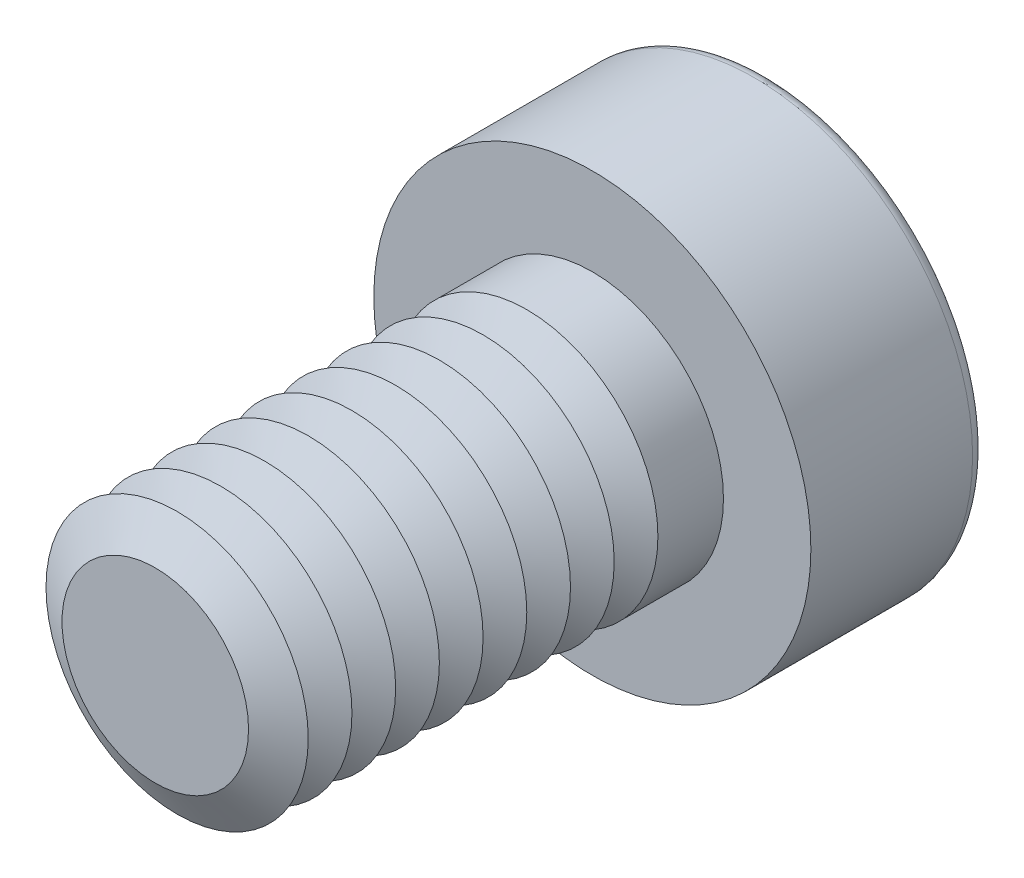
from build123d import *

# Parameters (mm, degrees)
SKETCH1_R           = 3
BOSS_EXTRUDE1_DEPTH = 10
SKETCH2_R           = 5
BOSS_EXTRUDE2_DEPTH = 4
CUT_EXTRUDE1_DEPTH  = 3
FILLET1_R           = 0.3
LPATTERN1_COUNT     = 9
LPATTERN1_PITCH     = 1


with BuildPart() as part:
    # Sketch1 → Boss-Extrude1 (new body)
    with BuildSketch(Plane.XY):
        Circle(SKETCH1_R)
    extrude(amount=BOSS_EXTRUDE1_DEPTH)

    # Sketch2 → Boss-Extrude2 (add)
    with BuildSketch(Plane(origin=(0, 0, 0), x_dir=(-1, 0, 0), z_dir=(0, 0, -1))):
        Circle(SKETCH2_R)
    extrude(amount=BOSS_EXTRUDE2_DEPTH)

    # Sketch3 → Cut-Extrude1 (cut)
    with BuildSketch(Plane(origin=(0, 0, -4), x_dir=(-1, 0, 0), z_dir=(0, 0, -1))):
        Polygon((-1.154700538, 2), (-2.309401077, 0), (-1.154700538, -2), (1.154700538, -2), (2.309401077, 0), (1.154700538, 2), align=None)
    extrude(amount=-CUT_EXTRUDE1_DEPTH, mode=Mode.SUBTRACT)

    # Fillet1
    fillet1_edges = [part.edges().sort_by_distance(p)[0] for p in [
        (5, 0, -4),
    ]]
    fillet(fillet1_edges, radius=FILLET1_R)

    # Cut-Extrude2 cone 1 section (on through the dimple's axis) → Cut-Extrude2 (revolve, cut)
    with BuildSketch(Plane(origin=(0, 0, -1), x_dir=(0, 1, 0), z_dir=(1, 0, 0))):
        Polygon((0, 0), (2, 0), (0, 1.154700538), align=None)
    revolve(axis=Axis((0, 0, -1), (0, 0, 1)), mode=Mode.SUBTRACT)

    # Cut-Extrude3 cone 1 section (on through the dimple's axis) → Cut-Extrude3 (revolve, cut)
    with BuildSketch(Plane(origin=(0, 0, -4), x_dir=(0, 1, 0), z_dir=(1, 0, 0))):
        Polygon((0, 0), (2.309401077, 0), (0, 0.618802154), align=None)
    revolve(axis=Axis((0, 0, -4), (0, 0, 1)), mode=Mode.SUBTRACT)

    # Sketch7 → Cut-Revolve1 (revolve, cut)
    with BuildSketch(Plane(origin=(0, 0, 0), x_dir=(0, 0, -1), z_dir=(1, 0, 0)), mode=Mode.PRIVATE) as cut_revolve1_sk:
        Polygon((-10, 2.133974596), (-9.5, 3), (-10.5, 3), align=None)
    cut_revolve1 = revolve(cut_revolve1_sk.sketch.rotate(Axis((0, 0, 10), (0, 0, -1)), 90), axis=Axis((0, 0, 10), (0, 0, -1)), mode=Mode.SUBTRACT)

    # LPattern1: Cut-Revolve1 ×9
    with Locations(*[(0, 0, -i * LPATTERN1_PITCH) for i in range(1, LPATTERN1_COUNT)]):
        add(cut_revolve1, mode=Mode.SUBTRACT)


solid = part.part
